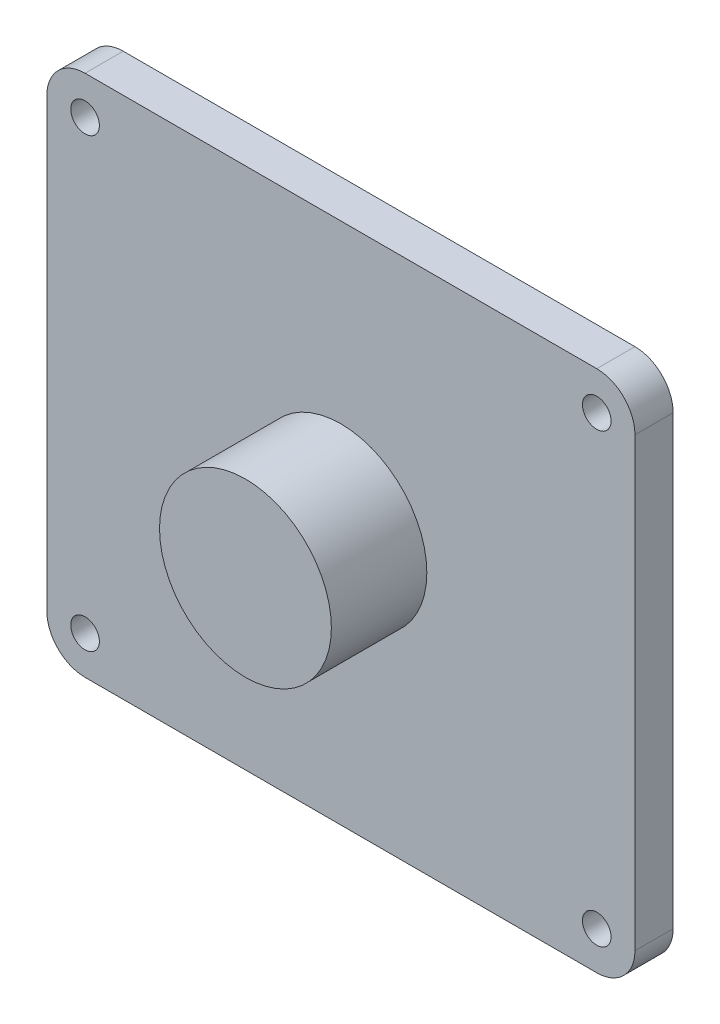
from build123d import *

# Parameters (mm, degrees)
SKETCH1_W                      = 154
SKETCH1_H                      = 137
EXTRUDE1_DEPTH                 = 10
SKETCH1_3_R                    = 22.5
EXTRUDE2_DEPTH                 = 35
FILLET1_R                      = 10
F_7_5_7_5_DIAMETER_HOLE1_D     = 7.5
F_7_5_7_5_DIAMETER_HOLE1_DEPTH = 25
F_7_5_7_5_DIAMETER_HOLE1_TIP   = 2.253227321


with BuildPart() as part:
    # Sketch1 → Extrude1 (new body)
    with BuildSketch(Plane.XY):
        Rectangle(SKETCH1_W, SKETCH1_H)
    extrude(amount=EXTRUDE1_DEPTH)

    # Sketch1_3 → Extrude2 (add)
    with BuildSketch(Plane.XY):
        Circle(SKETCH1_3_R)
    extrude(amount=EXTRUDE2_DEPTH)

    # Fillet1
    fillet1_edges = [part.edges().sort_by_distance(p)[0] for p in [
        (-77, -68.5, 5),
        (-77, 68.5, 5),
        (77, 68.5, 5),
        (77, -68.5, 5),
    ]]
    fillet(fillet1_edges, radius=FILLET1_R)

    # 7.5 _7.5_ Diameter Hole1
    with Locations(Plane.XY.offset(10)):
        with Locations((-67, -58.5), (-67, 58.5), (67, 58.5), (67, -58.5)):
            Hole(F_7_5_7_5_DIAMETER_HOLE1_D / 2, depth=F_7_5_7_5_DIAMETER_HOLE1_DEPTH)
            with Locations((0, 0, -(F_7_5_7_5_DIAMETER_HOLE1_DEPTH + F_7_5_7_5_DIAMETER_HOLE1_TIP / 2))):  # 118° drill point
                Cone(0, F_7_5_7_5_DIAMETER_HOLE1_D / 2, F_7_5_7_5_DIAMETER_HOLE1_TIP, mode=Mode.SUBTRACT)


solid = part.part
